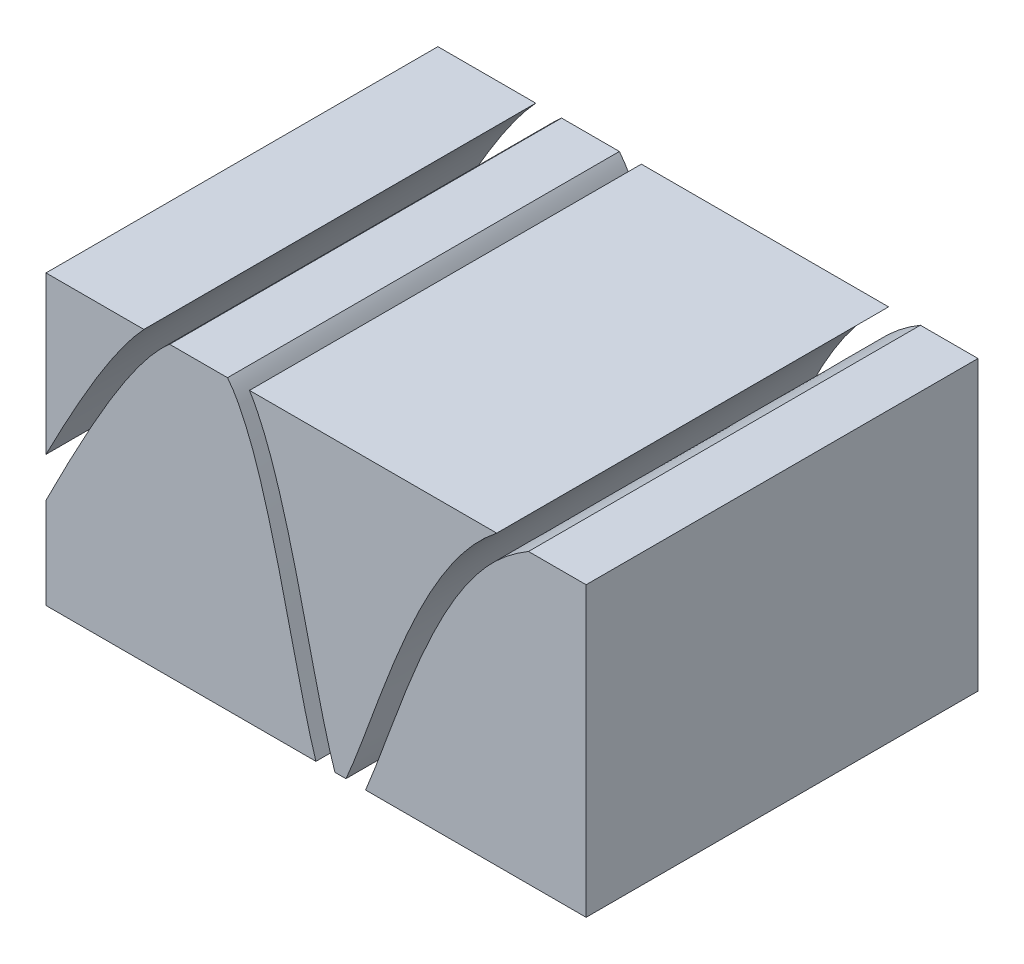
ISO-10303-21;
HEADER;
FILE_DESCRIPTION(('STEP AP214'),'2;1');
FILE_NAME('part.step','',(''),(''),'','','');
FILE_SCHEMA(('AUTOMOTIVE_DESIGN { 1 0 10303 214 1 1 1 1 }'));
ENDSEC;
DATA;
#1=APPLICATION_CONTEXT('core data for automotive mechanical design processes');
#2=APPLICATION_PROTOCOL_DEFINITION('international standard','automotive_design',2000,#1);
#3=PRODUCT_CONTEXT('',#1,'mechanical');
#4=PRODUCT('Part','Part','',(#3));
#5=PRODUCT_RELATED_PRODUCT_CATEGORY('part','',(#4));
#6=PRODUCT_DEFINITION_FORMATION('','',#4);
#7=PRODUCT_DEFINITION_CONTEXT('part definition',#1,'design');
#8=PRODUCT_DEFINITION('design','',#6,#7);
#9=PRODUCT_DEFINITION_SHAPE('','',#8);
#10=(LENGTH_UNIT() NAMED_UNIT(*) SI_UNIT(.MILLI.,.METRE.));
#11=(NAMED_UNIT(*) PLANE_ANGLE_UNIT() SI_UNIT($,.RADIAN.));
#12=(NAMED_UNIT(*) SI_UNIT($,.STERADIAN.) SOLID_ANGLE_UNIT());
#13=UNCERTAINTY_MEASURE_WITH_UNIT(LENGTH_MEASURE(1.E-05),#10,'distance_accuracy_value','');
#14=(GEOMETRIC_REPRESENTATION_CONTEXT(3) GLOBAL_UNCERTAINTY_ASSIGNED_CONTEXT((#13)) GLOBAL_UNIT_ASSIGNED_CONTEXT((#10,
#11,#12)) REPRESENTATION_CONTEXT('',''));
#15=CARTESIAN_POINT('',(0.,0.,0.));
#16=DIRECTION('',(0.,0.,1.));
#17=DIRECTION('',(1.,0.,0.));
#18=AXIS2_PLACEMENT_3D('',#15,#16,#17);
#19=CARTESIAN_POINT('',(-75.,-40.,-54.415169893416));
#20=DIRECTION('',(0.,0.,1.));
#21=DIRECTION('',(1.,0.,0.));
#22=AXIS2_PLACEMENT_3D('',#19,#20,#21);
#23=PLANE('',#22);
#24=DIRECTION('',(-1.,0.,0.));
#25=VECTOR('',#24,1.);
#26=CARTESIAN_POINT('',(-75.,40.,-54.415169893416));
#27=LINE('',#26,#25);
#28=CARTESIAN_POINT('',(-47.8204537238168,39.9999999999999,-54.4151698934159));
#29=VERTEX_POINT('',#28);
#30=CARTESIAN_POINT('',(-75.,40.,-54.415169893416));
#31=VERTEX_POINT('',#30);
#32=EDGE_CURVE('E87',#29,#31,#27,.T.);
#33=ORIENTED_EDGE('',*,*,#32,.F.);
#34=CARTESIAN_POINT('',(-47.8204537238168,39.9999999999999,-54.4151698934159));
#35=CARTESIAN_POINT('',(-48.0650466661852,39.7351296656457,-54.415169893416));
#36=CARTESIAN_POINT('',(-48.307176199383,39.4679981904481,-54.415169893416));
#37=CARTESIAN_POINT('',(-48.7868126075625,38.9296408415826,-54.415169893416));
#38=CARTESIAN_POINT('',(-49.0243197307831,38.6584151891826,-54.415169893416));
#39=CARTESIAN_POINT('',(-49.4949771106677,38.112343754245,-54.415169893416));
#40=CARTESIAN_POINT('',(-49.7281285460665,37.8374989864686,-54.415169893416));
#41=CARTESIAN_POINT('',(-50.190425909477,37.2844584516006,-54.415169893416));
#42=CARTESIAN_POINT('',(-50.4195717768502,37.0062626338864,-54.415169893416));
#43=CARTESIAN_POINT('',(-51.0991656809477,36.1698689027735,-54.415169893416));
#44=CARTESIAN_POINT('',(-51.5440828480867,35.6071684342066,-54.415169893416));
#45=CARTESIAN_POINT('',(-52.4209459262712,34.4717149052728,-54.415169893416));
#46=CARTESIAN_POINT('',(-52.8528907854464,33.8989610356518,-54.415169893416));
#47=CARTESIAN_POINT('',(-53.7044083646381,32.7462050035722,-54.415169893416));
#48=CARTESIAN_POINT('',(-54.1240052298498,32.1662206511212,-54.415169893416));
#49=CARTESIAN_POINT('',(-54.9530478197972,30.9990770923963,-54.415169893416));
#50=CARTESIAN_POINT('',(-55.3624938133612,30.4119180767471,-54.415169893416));
#51=CARTESIAN_POINT('',(-56.1720463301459,29.2318392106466,-54.415169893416));
#52=CARTESIAN_POINT('',(-56.5721594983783,28.638923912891,-54.415169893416));
#53=CARTESIAN_POINT('',(-57.3642988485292,27.4477163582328,-54.415169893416));
#54=CARTESIAN_POINT('',(-57.7563249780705,26.8494240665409,-54.415169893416));
#55=CARTESIAN_POINT('',(-58.5330438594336,25.6482256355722,-54.415169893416));
#56=CARTESIAN_POINT('',(-58.9177376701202,25.0453201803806,-54.415169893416));
#57=CARTESIAN_POINT('',(-59.6805541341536,23.8353634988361,-54.415169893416));
#58=CARTESIAN_POINT('',(-60.0586767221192,23.2283122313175,-54.415169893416));
#59=CARTESIAN_POINT('',(-61.1842126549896,21.4015408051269,-54.415169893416));
#60=CARTESIAN_POINT('',(-61.9227158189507,20.1763248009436,-54.415169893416));
#61=CARTESIAN_POINT('',(-63.378496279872,17.7169186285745,-54.415169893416));
#62=CARTESIAN_POINT('',(-64.09581550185,16.4827531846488,-54.415169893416));
#63=CARTESIAN_POINT('',(-65.5146536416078,14.0040624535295,-54.415169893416));
#64=CARTESIAN_POINT('',(-66.2161593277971,12.7595296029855,-54.415169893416));
#65=CARTESIAN_POINT('',(-67.6060739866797,10.2615762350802,-54.415169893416));
#66=CARTESIAN_POINT('',(-68.294469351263,9.00814815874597,-54.415169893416));
#67=CARTESIAN_POINT('',(-69.6603655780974,6.49359905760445,-54.415169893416));
#68=CARTESIAN_POINT('',(-70.3378536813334,5.23247111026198,-54.415169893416));
#69=CARTESIAN_POINT('',(-71.6837876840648,2.70353245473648,-54.415169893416));
#70=CARTESIAN_POINT('',(-72.352222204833,1.4357156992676,-54.415169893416));
#71=CARTESIAN_POINT('',(-73.681575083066,-1.10577640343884,-54.415169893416));
#72=CARTESIAN_POINT('',(-74.3424835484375,-2.37945692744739,-54.415169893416));
#73=CARTESIAN_POINT('',(-75.,-3.65487240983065,-54.415169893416));
#74=B_SPLINE_CURVE_WITH_KNOTS('',3,(#34,#35,#36,#37,#38,#39,#40,#41,#42,#43,#44,#45,#46,#47,#48,
#49,#50,#51,#52,#53,#54,#55,#56,#57,#58,#59,#60,#61,#62,#63,#64,#65,#66,#67,#68,#69,#70,#71,#72,
#73),.UNSPECIFIED.,.F.,.F.,(4,2,2,2,2,2,2,2,2,2,2,2,2,2,2,2,2,2,2,4),(0.,1.08156022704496,
2.16306220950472,3.24426714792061,4.32548844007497,6.47727767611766,8.62924092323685,
10.7766710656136,12.9240442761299,15.0698387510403,17.2156471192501,19.3611432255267,
21.5066606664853,25.798129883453,30.0804429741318,34.3662153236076,38.656217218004,
42.9509180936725,47.2505919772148,51.5553830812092),.UNSPECIFIED.);
#75=CARTESIAN_POINT('',(-75.,-3.65487240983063,-54.415169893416));
#76=VERTEX_POINT('',#75);
#77=EDGE_CURVE('E77',#29,#76,#74,.T.);
#78=ORIENTED_EDGE('',*,*,#77,.T.);
#79=DIRECTION('',(0.,-1.,0.));
#80=VECTOR('',#79,1.);
#81=CARTESIAN_POINT('',(-75.,40.,-54.415169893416));
#82=LINE('',#81,#80);
#83=EDGE_CURVE('E82',#31,#76,#82,.T.);
#84=ORIENTED_EDGE('',*,*,#83,.F.);
#85=EDGE_LOOP('',(#33,#78,#84));
#86=FACE_BOUND('',#85,.T.);
#87=ADVANCED_FACE('F44',(#86),#23,.F.);
#88=CARTESIAN_POINT('',(-75.,-40.,54.415169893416));
#89=DIRECTION('',(0.,0.,1.));
#90=DIRECTION('',(1.,0.,0.));
#91=AXIS2_PLACEMENT_3D('',#88,#89,#90);
#92=PLANE('',#91);
#93=CARTESIAN_POINT('',(-47.8204537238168,39.9999999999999,54.415169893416));
#94=CARTESIAN_POINT('',(-48.0650466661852,39.7351296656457,54.415169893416));
#95=CARTESIAN_POINT('',(-48.307176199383,39.4679981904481,54.415169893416));
#96=CARTESIAN_POINT('',(-48.7868126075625,38.9296408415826,54.415169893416));
#97=CARTESIAN_POINT('',(-49.0243197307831,38.6584151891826,54.415169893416));
#98=CARTESIAN_POINT('',(-49.4949771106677,38.112343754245,54.415169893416));
#99=CARTESIAN_POINT('',(-49.7281285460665,37.8374989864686,54.415169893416));
#100=CARTESIAN_POINT('',(-50.190425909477,37.2844584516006,54.415169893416));
#101=CARTESIAN_POINT('',(-50.4195717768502,37.0062626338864,54.415169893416));
#102=CARTESIAN_POINT('',(-51.0991656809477,36.1698689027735,54.415169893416));
#103=CARTESIAN_POINT('',(-51.5440828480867,35.6071684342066,54.415169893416));
#104=CARTESIAN_POINT('',(-52.4209459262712,34.4717149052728,54.415169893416));
#105=CARTESIAN_POINT('',(-52.8528907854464,33.8989610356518,54.415169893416));
#106=CARTESIAN_POINT('',(-53.7044083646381,32.7462050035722,54.415169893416));
#107=CARTESIAN_POINT('',(-54.1240052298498,32.1662206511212,54.415169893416));
#108=CARTESIAN_POINT('',(-54.9530478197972,30.9990770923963,54.415169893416));
#109=CARTESIAN_POINT('',(-55.3624938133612,30.4119180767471,54.415169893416));
#110=CARTESIAN_POINT('',(-56.1720463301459,29.2318392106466,54.415169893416));
#111=CARTESIAN_POINT('',(-56.5721594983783,28.638923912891,54.415169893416));
#112=CARTESIAN_POINT('',(-57.3642988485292,27.4477163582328,54.415169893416));
#113=CARTESIAN_POINT('',(-57.7563249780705,26.8494240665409,54.415169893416));
#114=CARTESIAN_POINT('',(-58.5330438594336,25.6482256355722,54.415169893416));
#115=CARTESIAN_POINT('',(-58.9177376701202,25.0453201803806,54.415169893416));
#116=CARTESIAN_POINT('',(-59.6805541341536,23.8353634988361,54.415169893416));
#117=CARTESIAN_POINT('',(-60.0586767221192,23.2283122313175,54.415169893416));
#118=CARTESIAN_POINT('',(-61.1842126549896,21.4015408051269,54.415169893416));
#119=CARTESIAN_POINT('',(-61.9227158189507,20.1763248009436,54.415169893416));
#120=CARTESIAN_POINT('',(-63.378496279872,17.7169186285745,54.415169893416));
#121=CARTESIAN_POINT('',(-64.09581550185,16.4827531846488,54.415169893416));
#122=CARTESIAN_POINT('',(-65.5146536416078,14.0040624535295,54.415169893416));
#123=CARTESIAN_POINT('',(-66.2161593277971,12.7595296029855,54.415169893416));
#124=CARTESIAN_POINT('',(-67.6060739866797,10.2615762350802,54.415169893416));
#125=CARTESIAN_POINT('',(-68.294469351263,9.00814815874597,54.415169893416));
#126=CARTESIAN_POINT('',(-69.6603655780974,6.49359905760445,54.415169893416));
#127=CARTESIAN_POINT('',(-70.3378536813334,5.23247111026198,54.415169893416));
#128=CARTESIAN_POINT('',(-71.6837876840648,2.70353245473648,54.415169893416));
#129=CARTESIAN_POINT('',(-72.352222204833,1.4357156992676,54.415169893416));
#130=CARTESIAN_POINT('',(-73.681575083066,-1.10577640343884,54.415169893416));
#131=CARTESIAN_POINT('',(-74.3424835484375,-2.37945692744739,54.415169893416));
#132=CARTESIAN_POINT('',(-75.,-3.65487240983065,54.415169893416));
#133=B_SPLINE_CURVE_WITH_KNOTS('',3,(#93,#94,#95,#96,#97,#98,#99,#100,#101,#102,#103,#104,#105,
#106,#107,#108,#109,#110,#111,#112,#113,#114,#115,#116,#117,#118,#119,#120,#121,#122,#123,#124,
#125,#126,#127,#128,#129,#130,#131,#132),.UNSPECIFIED.,.F.,.F.,(4,2,2,2,2,2,2,2,2,2,2,2,2,2,2,2,
2,2,2,4),(0.,1.08156022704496,2.16306220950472,3.24426714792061,4.32548844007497,
6.47727767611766,8.62924092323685,10.7766710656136,12.9240442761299,15.0698387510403,
17.2156471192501,19.3611432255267,21.5066606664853,25.798129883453,30.0804429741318,
34.3662153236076,38.656217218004,42.9509180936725,47.2505919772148,51.5553830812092),.UNSPECIFIED.);
#134=CARTESIAN_POINT('',(-47.8204537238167,40.,54.415169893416));
#135=VERTEX_POINT('',#134);
#136=CARTESIAN_POINT('',(-75.,-3.65487240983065,54.415169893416));
#137=VERTEX_POINT('',#136);
#138=EDGE_CURVE('E12',#135,#137,#133,.T.);
#139=ORIENTED_EDGE('',*,*,#138,.F.);
#140=DIRECTION('',(-1.,0.,0.));
#141=VECTOR('',#140,1.);
#142=CARTESIAN_POINT('',(-75.,40.,54.415169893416));
#143=LINE('',#142,#141);
#144=CARTESIAN_POINT('',(-75.,40.,54.415169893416));
#145=VERTEX_POINT('',#144);
#146=EDGE_CURVE('E48',#135,#145,#143,.T.);
#147=ORIENTED_EDGE('',*,*,#146,.T.);
#148=DIRECTION('',(0.,-1.,0.));
#149=VECTOR('',#148,1.);
#150=CARTESIAN_POINT('',(-75.,40.,54.415169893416));
#151=LINE('',#150,#149);
#152=EDGE_CURVE('E94',#145,#137,#151,.T.);
#153=ORIENTED_EDGE('',*,*,#152,.T.);
#154=EDGE_LOOP('',(#139,#147,#153));
#155=FACE_BOUND('',#154,.T.);
#156=ADVANCED_FACE('F102',(#155),#92,.T.);
#157=CARTESIAN_POINT('',(-75.,40.,54.415169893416));
#158=DIRECTION('',(0.,-1.,0.));
#159=DIRECTION('',(0.,0.,-1.));
#160=AXIS2_PLACEMENT_3D('',#157,#158,#159);
#161=PLANE('',#160);
#162=ORIENTED_EDGE('',*,*,#146,.F.);
#163=DIRECTION('',(0.,0.,-1.));
#164=VECTOR('',#163,1.);
#165=CARTESIAN_POINT('',(-47.8204537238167,40.,-4.02968962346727));
#166=LINE('',#165,#164);
#167=EDGE_CURVE('E60',#135,#29,#166,.T.);
#168=ORIENTED_EDGE('',*,*,#167,.T.);
#169=ORIENTED_EDGE('',*,*,#32,.T.);
#170=DIRECTION('',(0.,0.,-1.));
#171=VECTOR('',#170,1.);
#172=CARTESIAN_POINT('',(-75.,40.,54.415169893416));
#173=LINE('',#172,#171);
#174=EDGE_CURVE('E54',#145,#31,#173,.T.);
#175=ORIENTED_EDGE('',*,*,#174,.F.);
#176=EDGE_LOOP('',(#162,#168,#169,#175));
#177=FACE_BOUND('',#176,.T.);
#178=ADVANCED_FACE('F46',(#177),#161,.F.);
#179=CARTESIAN_POINT('',(-75.,40.,54.415169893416));
#180=DIRECTION('',(1.,0.,0.));
#181=DIRECTION('',(0.,0.,-1.));
#182=AXIS2_PLACEMENT_3D('',#179,#180,#181);
#183=PLANE('',#182);
#184=ORIENTED_EDGE('',*,*,#83,.T.);
#185=DIRECTION('',(0.,0.,-1.));
#186=VECTOR('',#185,1.);
#187=CARTESIAN_POINT('',(-75.,-3.65487240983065,-4.02968962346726));
#188=LINE('',#187,#186);
#189=EDGE_CURVE('E74',#76,#137,#188,.F.);
#190=ORIENTED_EDGE('',*,*,#189,.T.);
#191=ORIENTED_EDGE('',*,*,#152,.F.);
#192=ORIENTED_EDGE('',*,*,#174,.T.);
#193=EDGE_LOOP('',(#184,#190,#191,#192));
#194=FACE_BOUND('',#193,.T.);
#195=ADVANCED_FACE('F90',(#194),#183,.F.);
#196=CARTESIAN_POINT('',(-83.9374165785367,-32.6773889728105,54.415169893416));
#197=CARTESIAN_POINT('',(-62.3191849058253,11.1229468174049,54.415169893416));
#198=CARTESIAN_POINT('',(-19.1954598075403,98.4952013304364,54.415169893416));
#199=CARTESIAN_POINT('',(-4.17842900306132,-41.1856863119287,54.415169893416));
#200=CARTESIAN_POINT('',(4.56571127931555,-49.6995801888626,54.415169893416));
#201=B_SPLINE_CURVE_WITH_KNOTS('',3,(#196,#197,#198,#199,#200),.UNSPECIFIED.,.F.,.F.,(4,1,4),
(0.,0.279005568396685,0.55655613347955),.UNSPECIFIED.);
#202=DIRECTION('',(0.,0.,-1.));
#203=VECTOR('',#202,1.);
#204=SURFACE_OF_LINEAR_EXTRUSION('',#201,#203);
#205=OFFSET_SURFACE('',#204,5.,.F.);
#206=ORIENTED_EDGE('',*,*,#138,.T.);
#207=ORIENTED_EDGE('',*,*,#189,.F.);
#208=ORIENTED_EDGE('',*,*,#77,.F.);
#209=ORIENTED_EDGE('',*,*,#167,.F.);
#210=EDGE_LOOP('',(#206,#207,#208,#209));
#211=FACE_BOUND('',#210,.T.);
#212=ADVANCED_FACE('F76',(#211),#205,.F.);
#213=CLOSED_SHELL('',(#87,#156,#178,#195,#212));
#214=MANIFOLD_SOLID_BREP('B2',#213);
#215=CARTESIAN_POINT('',(-75.,-40.,-54.415169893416));
#216=DIRECTION('',(0.,0.,1.));
#217=DIRECTION('',(1.,0.,0.));
#218=AXIS2_PLACEMENT_3D('',#215,#216,#217);
#219=PLANE('',#218);
#220=DIRECTION('',(-1.,0.,0.));
#221=VECTOR('',#220,1.);
#222=CARTESIAN_POINT('',(-75.,40.,-54.415169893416));
#223=LINE('',#222,#221);
#224=CARTESIAN_POINT('',(50.1739328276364,40.,-54.415169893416));
#225=VERTEX_POINT('',#224);
#226=CARTESIAN_POINT('',(-18.4845193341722,40.,-54.415169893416));
#227=VERTEX_POINT('',#226);
#228=EDGE_CURVE('E230',#225,#227,#223,.T.);
#229=ORIENTED_EDGE('',*,*,#228,.F.);
#230=CARTESIAN_POINT('',(50.1739328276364,40.,-54.415169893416));
#231=CARTESIAN_POINT('',(49.8661701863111,39.7557694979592,-54.415169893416));
#232=CARTESIAN_POINT('',(49.5610902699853,39.5081865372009,-54.415169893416));
#233=CARTESIAN_POINT('',(48.9564054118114,39.0064277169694,-54.415169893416));
#234=CARTESIAN_POINT('',(48.6568004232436,38.7522519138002,-54.415169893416));
#235=CARTESIAN_POINT('',(47.7692635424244,37.9825199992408,-54.415169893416));
#236=CARTESIAN_POINT('',(47.1895914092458,37.4573631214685,-54.415169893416));
#237=CARTESIAN_POINT('',(46.3383616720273,36.6523158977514,-54.415169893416));
#238=CARTESIAN_POINT('',(46.0581088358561,36.3815389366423,-54.415169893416));
#239=CARTESIAN_POINT('',(45.5033876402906,35.8341128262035,-54.415169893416));
#240=CARTESIAN_POINT('',(45.2289192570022,35.5574637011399,-54.415169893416));
#241=CARTESIAN_POINT('',(44.6863760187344,34.9989855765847,-54.415169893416));
#242=CARTESIAN_POINT('',(44.4182900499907,34.7171673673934,-54.415169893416));
#243=CARTESIAN_POINT('',(43.8878941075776,34.148153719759,-54.415169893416));
#244=CARTESIAN_POINT('',(43.6255841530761,33.8609582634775,-54.415169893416));
#245=CARTESIAN_POINT('',(42.8474089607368,32.9923094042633,-54.415169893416));
#246=CARTESIAN_POINT('',(42.3398795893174,32.4033607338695,-54.415169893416));
#247=CARTESIAN_POINT('',(41.3457009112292,31.2081241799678,-54.415169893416));
#248=CARTESIAN_POINT('',(40.8590524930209,30.6018355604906,-54.415169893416));
#249=CARTESIAN_POINT('',(39.9136192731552,29.3849686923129,-54.415169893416));
#250=CARTESIAN_POINT('',(39.454494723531,28.7746539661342,-54.415169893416));
#251=CARTESIAN_POINT('',(38.5533772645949,27.5407777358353,-54.415169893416));
#252=CARTESIAN_POINT('',(38.1113984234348,26.9172059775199,-54.415169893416));
#253=CARTESIAN_POINT('',(37.243371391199,25.6583424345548,-54.415169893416));
#254=CARTESIAN_POINT('',(36.8173364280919,25.023041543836,-54.415169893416));
#255=CARTESIAN_POINT('',(35.9801437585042,23.7421532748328,-54.415169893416));
#256=CARTESIAN_POINT('',(35.5689956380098,23.0965596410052,-54.415169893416));
#257=CARTESIAN_POINT('',(34.7606431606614,21.7964400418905,-54.415169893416));
#258=CARTESIAN_POINT('',(34.3634430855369,21.1419114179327,-54.415169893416));
#259=CARTESIAN_POINT('',(33.5821590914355,19.8252132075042,-54.415169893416));
#260=CARTESIAN_POINT('',(33.1980732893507,19.1630447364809,-54.4151698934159));
#261=CARTESIAN_POINT('',(32.3009322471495,17.5834528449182,-54.4151698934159));
#262=CARTESIAN_POINT('',(31.7932345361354,16.6629850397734,-54.4151698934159));
#263=CARTESIAN_POINT('',(30.7987142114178,14.8115582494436,-54.415169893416));
#264=CARTESIAN_POINT('',(30.3118796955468,13.8806056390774,-54.415169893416));
#265=CARTESIAN_POINT('',(29.356877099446,12.009497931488,-54.415169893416));
#266=CARTESIAN_POINT('',(28.8887041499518,11.0693453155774,-54.415169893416));
#267=CARTESIAN_POINT('',(27.96909861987,9.18100201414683,-54.415169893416));
#268=CARTESIAN_POINT('',(27.5176646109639,8.23281202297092,-54.415169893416));
#269=CARTESIAN_POINT('',(26.6298285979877,6.32944694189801,-54.415169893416));
#270=CARTESIAN_POINT('',(26.1934263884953,5.37427194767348,-54.415169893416));
#271=CARTESIAN_POINT('',(25.3305588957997,3.44997207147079,-54.415169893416));
#272=CARTESIAN_POINT('',(24.904205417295,2.48079712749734,-54.415169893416));
#273=CARTESIAN_POINT('',(24.0637231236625,0.537133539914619,-54.415169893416));
#274=CARTESIAN_POINT('',(23.6495946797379,-0.437355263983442,-54.415169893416));
#275=CARTESIAN_POINT('',(22.8321645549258,-2.39092053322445,-54.415169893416));
#276=CARTESIAN_POINT('',(22.4288634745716,-3.3699972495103,-54.415169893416));
#277=CARTESIAN_POINT('',(21.6317661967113,-5.33204317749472,-54.415169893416));
#278=CARTESIAN_POINT('',(21.237970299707,-6.31501251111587,-54.415169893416));
#279=CARTESIAN_POINT('',(20.4586035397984,-8.28416509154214,-54.415169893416));
#280=CARTESIAN_POINT('',(20.0730324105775,-9.27034823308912,-54.415169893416));
#281=CARTESIAN_POINT('',(19.2091855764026,-11.5028060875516,-54.415169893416));
#282=CARTESIAN_POINT('',(18.732944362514,-12.7498672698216,-54.415169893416));
#283=CARTESIAN_POINT('',(17.7887517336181,-15.247033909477,-54.4151698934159));
#284=CARTESIAN_POINT('',(17.3207998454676,-16.4971391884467,-54.415169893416));
#285=CARTESIAN_POINT('',(16.3902010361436,-18.9992813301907,-54.415169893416));
#286=CARTESIAN_POINT('',(15.9275539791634,-20.2513181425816,-54.415169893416));
#287=CARTESIAN_POINT('',(15.004139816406,-22.7560458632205,-54.415169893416));
#288=CARTESIAN_POINT('',(14.5433726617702,-24.0087367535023,-54.415169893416));
#289=CARTESIAN_POINT('',(13.8530351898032,-25.8798837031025,-54.415169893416));
#290=CARTESIAN_POINT('',(13.6243951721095,-26.4986824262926,-54.415169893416));
#291=CARTESIAN_POINT('',(13.1658535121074,-27.7358105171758,-54.415169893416));
#292=CARTESIAN_POINT('',(12.9359518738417,-28.3541398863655,-54.415169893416));
#293=CARTESIAN_POINT('',(12.4741287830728,-29.590030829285,-54.415169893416));
#294=CARTESIAN_POINT('',(12.2422073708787,-30.2075924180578,-54.415169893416));
#295=CARTESIAN_POINT('',(11.7754024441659,-31.4416062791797,-54.415169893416));
#296=CARTESIAN_POINT('',(11.540518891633,-32.0580585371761,-54.415169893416));
#297=CARTESIAN_POINT('',(11.0665967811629,-33.2894307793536,-54.415169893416));
#298=CARTESIAN_POINT('',(10.827557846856,-33.9043506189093,-54.415169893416));
#299=CARTESIAN_POINT('',(10.3438364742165,-35.1319498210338,-54.415169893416));
#300=CARTESIAN_POINT('',(10.0991542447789,-35.7446292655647,-54.415169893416));
#301=CARTESIAN_POINT('',(9.72624978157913,-36.6614687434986,-54.415169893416));
#302=CARTESIAN_POINT('',(9.60092991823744,-36.9668092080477,-54.415169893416));
#303=CARTESIAN_POINT('',(9.34800244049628,-37.5765385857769,-54.415169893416));
#304=CARTESIAN_POINT('',(9.22039484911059,-37.880927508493,-54.415169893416));
#305=CARTESIAN_POINT('',(8.96247324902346,-38.4886040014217,-54.415169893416));
#306=CARTESIAN_POINT('',(8.83215890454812,-38.7918914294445,-54.415169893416));
#307=CARTESIAN_POINT('',(8.56829301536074,-39.3970662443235,-54.415169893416));
#308=CARTESIAN_POINT('',(8.43474135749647,-39.6989535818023,-54.415169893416));
#309=CARTESIAN_POINT('',(8.29930247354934,-40.,-54.415169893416));
#310=B_SPLINE_CURVE_WITH_KNOTS('',3,(#230,#231,#232,#233,#234,#235,#236,#237,#238,#239,#240,
#241,#242,#243,#244,#245,#246,#247,#248,#249,#250,#251,#252,#253,#254,#255,#256,#257,#258,#259,
#260,#261,#262,#263,#264,#265,#266,#267,#268,#269,#270,#271,#272,#273,#274,#275,#276,#277,#278,
#279,#280,#281,#282,#283,#284,#285,#286,#287,#288,#289,#290,#291,#292,#293,#294,#295,#296,#297,
#298,#299,#300,#301,#302,#303,#304,#305,#306,#307,#308,#309),.UNSPECIFIED.,.F.,.F.,(4,2,2,2,2,2,
2,2,2,2,2,2,2,2,2,2,2,2,2,2,2,2,2,2,2,2,2,2,2,2,2,2,2,2,2,2,2,2,2,4),(0.,1.17862641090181,
2.35724275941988,4.70292329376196,5.87194164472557,7.04095516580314,8.20775697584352,
9.37456265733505,11.7063685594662,14.038273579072,16.3291169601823,18.6218018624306,
20.9163485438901,23.2123473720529,25.5090449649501,27.8054113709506,30.9586962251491,
34.1101575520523,37.2607911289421,40.4111552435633,43.5614762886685,46.7378099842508,
49.9142400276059,53.0908458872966,56.2675520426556,59.4441551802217,63.4488233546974,
67.4532622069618,71.4575983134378,75.4618296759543,77.440892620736,79.4199492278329,
81.3989664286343,83.3780090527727,85.357231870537,87.3363815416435,88.3265461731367,
89.3167008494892,90.3069790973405,91.2972920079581),.UNSPECIFIED.);
#311=CARTESIAN_POINT('',(8.29930247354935,-40.,-54.415169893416));
#312=VERTEX_POINT('',#311);
#313=EDGE_CURVE('E42',#225,#312,#310,.T.);
#314=ORIENTED_EDGE('',*,*,#313,.T.);
#315=DIRECTION('',(1.,0.,0.));
#316=VECTOR('',#315,1.);
#317=CARTESIAN_POINT('',(-75.,-40.,-54.415169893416));
#318=LINE('',#317,#316);
#319=CARTESIAN_POINT('',(5.2373061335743,-40.,-54.415169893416));
#320=VERTEX_POINT('',#319);
#321=EDGE_CURVE('E225',#320,#312,#318,.T.);
#322=ORIENTED_EDGE('',*,*,#321,.F.);
#323=CARTESIAN_POINT('',(5.2373061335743,-40.,-54.415169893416));
#324=CARTESIAN_POINT('',(5.15685385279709,-39.7666405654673,-54.415169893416));
#325=CARTESIAN_POINT('',(5.07763011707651,-39.5328614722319,-54.415169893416));
#326=CARTESIAN_POINT('',(4.92138039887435,-39.0645749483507,-54.415169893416));
#327=CARTESIAN_POINT('',(4.84435437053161,-38.8300675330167,-54.415169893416));
#328=CARTESIAN_POINT('',(4.61619309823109,-38.1256484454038,-54.415169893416));
#329=CARTESIAN_POINT('',(4.46795974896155,-37.6547963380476,-54.415169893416));
#330=CARTESIAN_POINT('',(4.17791118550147,-36.71183076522,-54.415169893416));
#331=CARTESIAN_POINT('',(4.0360875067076,-36.2397198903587,-54.415169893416));
#332=CARTESIAN_POINT('',(3.75753148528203,-35.2939876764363,-54.415169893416));
#333=CARTESIAN_POINT('',(3.6207992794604,-34.820366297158,-54.415169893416));
#334=CARTESIAN_POINT('',(3.35165757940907,-33.8722152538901,-54.415169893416));
#335=CARTESIAN_POINT('',(3.21924547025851,-33.3976863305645,-54.415169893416));
#336=CARTESIAN_POINT('',(2.95798811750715,-32.4476541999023,-54.415169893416));
#337=CARTESIAN_POINT('',(2.82914284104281,-31.9721510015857,-54.415169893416));
#338=CARTESIAN_POINT('',(2.44718140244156,-30.5446981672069,-54.415169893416));
#339=CARTESIAN_POINT('',(2.19856622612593,-29.5915442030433,-54.415169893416));
#340=CARTESIAN_POINT('',(1.71004327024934,-27.6831366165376,-54.415169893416));
#341=CARTESIAN_POINT('',(1.47013450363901,-26.7278832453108,-54.415169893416));
#342=CARTESIAN_POINT('',(0.996620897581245,-24.8158450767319,-54.415169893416));
#343=CARTESIAN_POINT('',(0.763015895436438,-23.8590603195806,-54.415169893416));
#344=CARTESIAN_POINT('',(0.300506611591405,-21.9454464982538,-54.415169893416));
#345=CARTESIAN_POINT('',(0.071597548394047,-20.9886185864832,-54.415169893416));
#346=CARTESIAN_POINT('',(-0.383289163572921,-19.0741242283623,-54.415169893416));
#347=CARTESIAN_POINT('',(-0.60926639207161,-18.1164576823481,-54.415169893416));
#348=CARTESIAN_POINT('',(-1.05954071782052,-16.2005464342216,-54.415169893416));
#349=CARTESIAN_POINT('',(-1.28383750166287,-15.2423016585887,-54.415169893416));
#350=CARTESIAN_POINT('',(-1.73184229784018,-13.3254569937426,-54.415169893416));
#351=CARTESIAN_POINT('',(-1.95555017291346,-12.3668570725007,-54.415169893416));
#352=CARTESIAN_POINT('',(-2.40336506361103,-10.4495009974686,-54.415169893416));
#353=CARTESIAN_POINT('',(-2.6274721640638,-9.49074486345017,-54.415169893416));
#354=CARTESIAN_POINT('',(-3.07701170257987,-7.57326107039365,-54.415169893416));
#355=CARTESIAN_POINT('',(-3.30244449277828,-6.61453349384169,-54.415169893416));
#356=CARTESIAN_POINT('',(-3.836557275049,-4.35442619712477,-54.415169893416));
#357=CARTESIAN_POINT('',(-4.14614531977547,-3.05326050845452,-54.415169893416));
#358=CARTESIAN_POINT('',(-4.77153470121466,-0.452308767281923,-54.4151698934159));
#359=CARTESIAN_POINT('',(-5.08733653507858,0.847477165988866,-54.415169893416));
#360=CARTESIAN_POINT('',(-5.7273883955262,3.44467508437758,-54.415169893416));
#361=CARTESIAN_POINT('',(-6.05163658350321,4.74208752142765,-54.415169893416));
#362=CARTESIAN_POINT('',(-6.71104850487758,7.33348690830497,-54.415169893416));
#363=CARTESIAN_POINT('',(-7.04620696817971,8.62747519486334,-54.415169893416));
#364=CARTESIAN_POINT('',(-7.73029066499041,11.2108739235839,-54.415169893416));
#365=CARTESIAN_POINT('',(-8.07920636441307,12.500286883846,-54.415169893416));
#366=CARTESIAN_POINT('',(-8.79422725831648,15.0732571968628,-54.415169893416));
#367=CARTESIAN_POINT('',(-9.16031849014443,16.3568184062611,-54.415169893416));
#368=CARTESIAN_POINT('',(-9.72621486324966,18.2786895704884,-54.415169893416));
#369=CARTESIAN_POINT('',(-9.91785094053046,18.9194078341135,-54.415169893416));
#370=CARTESIAN_POINT('',(-10.3072748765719,20.1989700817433,-54.415169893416));
#371=CARTESIAN_POINT('',(-10.5050626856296,20.8378140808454,-54.415169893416));
#372=CARTESIAN_POINT('',(-10.9075206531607,22.1132527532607,-54.415169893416));
#373=CARTESIAN_POINT('',(-11.1121900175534,22.749847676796,-54.415169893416));
#374=CARTESIAN_POINT('',(-11.5293069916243,24.0204790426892,-54.415169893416));
#375=CARTESIAN_POINT('',(-11.7417544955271,24.6545155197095,-54.415169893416));
#376=CARTESIAN_POINT('',(-12.1755075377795,25.9197300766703,-54.415169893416));
#377=CARTESIAN_POINT('',(-12.3968152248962,26.550907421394,-54.415169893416));
#378=CARTESIAN_POINT('',(-12.8494486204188,27.8096576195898,-54.415169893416));
#379=CARTESIAN_POINT('',(-13.080774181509,28.4372305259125,-54.415169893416));
#380=CARTESIAN_POINT('',(-13.5551547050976,29.6887290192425,-54.415169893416));
#381=CARTESIAN_POINT('',(-13.7982223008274,30.3126498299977,-54.415169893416));
#382=CARTESIAN_POINT('',(-14.2976200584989,31.5552228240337,-54.415169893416));
#383=CARTESIAN_POINT('',(-14.5539510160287,32.1738746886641,-54.415169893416));
#384=CARTESIAN_POINT('',(-15.0828841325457,33.4066515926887,-54.415169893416));
#385=CARTESIAN_POINT('',(-15.355537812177,34.0207545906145,-54.415169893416));
#386=CARTESIAN_POINT('',(-15.9189557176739,35.2405247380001,-54.415169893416));
#387=CARTESIAN_POINT('',(-16.2097167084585,35.8461933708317,-54.415169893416));
#388=CARTESIAN_POINT('',(-16.663232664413,36.7491591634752,-54.415169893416));
#389=CARTESIAN_POINT('',(-16.8179898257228,37.0504828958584,-54.415169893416));
#390=CARTESIAN_POINT('',(-17.1334724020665,37.6499826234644,-54.415169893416));
#391=CARTESIAN_POINT('',(-17.2941975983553,37.9481587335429,-54.415169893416));
#392=CARTESIAN_POINT('',(-17.6222714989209,38.5410897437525,-54.415169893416));
#393=CARTESIAN_POINT('',(-17.7896241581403,38.8358424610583,-54.415169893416));
#394=CARTESIAN_POINT('',(-18.1315219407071,39.421193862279,-54.415169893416));
#395=CARTESIAN_POINT('',(-18.3060679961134,39.7117920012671,-54.415169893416));
#396=CARTESIAN_POINT('',(-18.4845193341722,40.,-54.415169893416));
#397=B_SPLINE_CURVE_WITH_KNOTS('',3,(#323,#324,#325,#326,#327,#328,#329,#330,#331,#332,#333,
#334,#335,#336,#337,#338,#339,#340,#341,#342,#343,#344,#345,#346,#347,#348,#349,#350,#351,#352,
#353,#354,#355,#356,#357,#358,#359,#360,#361,#362,#363,#364,#365,#366,#367,#368,#369,#370,#371,
#372,#373,#374,#375,#376,#377,#378,#379,#380,#381,#382,#383,#384,#385,#386,#387,#388,#389,#390,
#391,#392,#393,#394,#395,#396),.UNSPECIFIED.,.F.,.F.,(4,2,2,2,2,2,2,2,2,2,2,2,2,2,2,2,2,2,2,2,2,
2,2,2,2,2,2,2,2,2,2,2,2,2,2,2,4),(0.,0.740506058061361,1.48099665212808,2.96183963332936,
4.44066617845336,5.91953243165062,7.3974862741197,8.87542649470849,11.8304933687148,
14.7852241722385,17.7398786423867,20.6913581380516,23.6432561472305,26.5956916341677,
29.5487632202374,32.5025630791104,35.4571865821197,39.4696438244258,43.4824234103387,
47.4943366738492,51.5043399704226,55.5116114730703,59.5156799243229,61.5219447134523,
63.5281932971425,65.5342111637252,67.5402017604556,69.5466818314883,71.5531324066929,
73.5617920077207,75.5705722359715,77.5860665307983,79.6012017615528,80.6173710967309,
81.6335032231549,82.6502511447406,83.6671312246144),.UNSPECIFIED.);
#398=EDGE_CURVE('E184',#320,#227,#397,.T.);
#399=ORIENTED_EDGE('',*,*,#398,.T.);
#400=EDGE_LOOP('',(#229,#314,#322,#399));
#401=FACE_BOUND('',#400,.T.);
#402=ADVANCED_FACE('F171',(#401),#219,.F.);
#403=CARTESIAN_POINT('',(-75.,-40.,54.415169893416));
#404=DIRECTION('',(0.,0.,1.));
#405=DIRECTION('',(1.,0.,0.));
#406=AXIS2_PLACEMENT_3D('',#403,#404,#405);
#407=PLANE('',#406);
#408=CARTESIAN_POINT('',(50.1739328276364,40.,54.415169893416));
#409=CARTESIAN_POINT('',(49.8661701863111,39.7557694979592,54.415169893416));
#410=CARTESIAN_POINT('',(49.5610902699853,39.5081865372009,54.415169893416));
#411=CARTESIAN_POINT('',(48.9564054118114,39.0064277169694,54.415169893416));
#412=CARTESIAN_POINT('',(48.6568004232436,38.7522519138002,54.415169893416));
#413=CARTESIAN_POINT('',(47.7692635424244,37.9825199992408,54.415169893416));
#414=CARTESIAN_POINT('',(47.1895914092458,37.4573631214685,54.415169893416));
#415=CARTESIAN_POINT('',(46.3383616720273,36.6523158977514,54.415169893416));
#416=CARTESIAN_POINT('',(46.0581088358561,36.3815389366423,54.415169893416));
#417=CARTESIAN_POINT('',(45.5033876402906,35.8341128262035,54.415169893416));
#418=CARTESIAN_POINT('',(45.2289192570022,35.5574637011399,54.415169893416));
#419=CARTESIAN_POINT('',(44.6863760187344,34.9989855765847,54.415169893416));
#420=CARTESIAN_POINT('',(44.4182900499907,34.7171673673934,54.415169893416));
#421=CARTESIAN_POINT('',(43.8878941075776,34.148153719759,54.415169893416));
#422=CARTESIAN_POINT('',(43.6255841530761,33.8609582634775,54.415169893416));
#423=CARTESIAN_POINT('',(42.8474089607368,32.9923094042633,54.415169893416));
#424=CARTESIAN_POINT('',(42.3398795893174,32.4033607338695,54.415169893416));
#425=CARTESIAN_POINT('',(41.3457009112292,31.2081241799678,54.415169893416));
#426=CARTESIAN_POINT('',(40.8590524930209,30.6018355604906,54.415169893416));
#427=CARTESIAN_POINT('',(39.9136192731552,29.3849686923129,54.415169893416));
#428=CARTESIAN_POINT('',(39.454494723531,28.7746539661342,54.415169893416));
#429=CARTESIAN_POINT('',(38.5533772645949,27.5407777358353,54.415169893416));
#430=CARTESIAN_POINT('',(38.1113984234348,26.9172059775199,54.415169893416));
#431=CARTESIAN_POINT('',(37.243371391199,25.6583424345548,54.415169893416));
#432=CARTESIAN_POINT('',(36.8173364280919,25.023041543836,54.415169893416));
#433=CARTESIAN_POINT('',(35.9801437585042,23.7421532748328,54.415169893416));
#434=CARTESIAN_POINT('',(35.5689956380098,23.0965596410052,54.415169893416));
#435=CARTESIAN_POINT('',(34.7606431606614,21.7964400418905,54.415169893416));
#436=CARTESIAN_POINT('',(34.3634430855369,21.1419114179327,54.415169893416));
#437=CARTESIAN_POINT('',(33.5821590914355,19.8252132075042,54.415169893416));
#438=CARTESIAN_POINT('',(33.1980732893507,19.1630447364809,54.415169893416));
#439=CARTESIAN_POINT('',(32.3009322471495,17.5834528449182,54.415169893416));
#440=CARTESIAN_POINT('',(31.7932345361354,16.6629850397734,54.415169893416));
#441=CARTESIAN_POINT('',(30.7987142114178,14.8115582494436,54.4151698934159));
#442=CARTESIAN_POINT('',(30.3118796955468,13.8806056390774,54.415169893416));
#443=CARTESIAN_POINT('',(29.356877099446,12.009497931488,54.415169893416));
#444=CARTESIAN_POINT('',(28.8887041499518,11.0693453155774,54.415169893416));
#445=CARTESIAN_POINT('',(27.96909861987,9.18100201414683,54.415169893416));
#446=CARTESIAN_POINT('',(27.5176646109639,8.23281202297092,54.415169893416));
#447=CARTESIAN_POINT('',(26.6298285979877,6.32944694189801,54.415169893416));
#448=CARTESIAN_POINT('',(26.1934263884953,5.37427194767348,54.415169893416));
#449=CARTESIAN_POINT('',(25.3305588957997,3.44997207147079,54.415169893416));
#450=CARTESIAN_POINT('',(24.904205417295,2.48079712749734,54.415169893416));
#451=CARTESIAN_POINT('',(24.0637231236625,0.537133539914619,54.415169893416));
#452=CARTESIAN_POINT('',(23.6495946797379,-0.437355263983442,54.415169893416));
#453=CARTESIAN_POINT('',(22.8321645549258,-2.39092053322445,54.415169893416));
#454=CARTESIAN_POINT('',(22.4288634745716,-3.3699972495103,54.415169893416));
#455=CARTESIAN_POINT('',(21.6317661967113,-5.33204317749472,54.415169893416));
#456=CARTESIAN_POINT('',(21.237970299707,-6.31501251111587,54.415169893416));
#457=CARTESIAN_POINT('',(20.4586035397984,-8.28416509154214,54.415169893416));
#458=CARTESIAN_POINT('',(20.0730324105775,-9.27034823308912,54.415169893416));
#459=CARTESIAN_POINT('',(19.2091855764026,-11.5028060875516,54.415169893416));
#460=CARTESIAN_POINT('',(18.732944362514,-12.7498672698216,54.415169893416));
#461=CARTESIAN_POINT('',(17.7887517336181,-15.247033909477,54.415169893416));
#462=CARTESIAN_POINT('',(17.3207998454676,-16.4971391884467,54.415169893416));
#463=CARTESIAN_POINT('',(16.3902010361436,-18.9992813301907,54.415169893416));
#464=CARTESIAN_POINT('',(15.9275539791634,-20.2513181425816,54.415169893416));
#465=CARTESIAN_POINT('',(15.004139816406,-22.7560458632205,54.415169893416));
#466=CARTESIAN_POINT('',(14.5433726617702,-24.0087367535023,54.415169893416));
#467=CARTESIAN_POINT('',(13.8530351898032,-25.8798837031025,54.415169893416));
#468=CARTESIAN_POINT('',(13.6243951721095,-26.4986824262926,54.415169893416));
#469=CARTESIAN_POINT('',(13.1658535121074,-27.7358105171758,54.415169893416));
#470=CARTESIAN_POINT('',(12.9359518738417,-28.3541398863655,54.415169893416));
#471=CARTESIAN_POINT('',(12.4741287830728,-29.590030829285,54.415169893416));
#472=CARTESIAN_POINT('',(12.2422073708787,-30.2075924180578,54.415169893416));
#473=CARTESIAN_POINT('',(11.7754024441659,-31.4416062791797,54.415169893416));
#474=CARTESIAN_POINT('',(11.540518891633,-32.0580585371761,54.415169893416));
#475=CARTESIAN_POINT('',(11.0665967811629,-33.2894307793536,54.415169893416));
#476=CARTESIAN_POINT('',(10.827557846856,-33.9043506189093,54.415169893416));
#477=CARTESIAN_POINT('',(10.3438364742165,-35.1319498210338,54.415169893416));
#478=CARTESIAN_POINT('',(10.0991542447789,-35.7446292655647,54.415169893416));
#479=CARTESIAN_POINT('',(9.72624978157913,-36.6614687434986,54.415169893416));
#480=CARTESIAN_POINT('',(9.60092991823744,-36.9668092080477,54.415169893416));
#481=CARTESIAN_POINT('',(9.34800244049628,-37.5765385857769,54.415169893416));
#482=CARTESIAN_POINT('',(9.22039484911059,-37.880927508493,54.415169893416));
#483=CARTESIAN_POINT('',(8.96247324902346,-38.4886040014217,54.415169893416));
#484=CARTESIAN_POINT('',(8.83215890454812,-38.7918914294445,54.415169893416));
#485=CARTESIAN_POINT('',(8.56829301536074,-39.3970662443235,54.415169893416));
#486=CARTESIAN_POINT('',(8.43474135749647,-39.6989535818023,54.415169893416));
#487=CARTESIAN_POINT('',(8.29930247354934,-40.,54.415169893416));
#488=B_SPLINE_CURVE_WITH_KNOTS('',3,(#408,#409,#410,#411,#412,#413,#414,#415,#416,#417,#418,
#419,#420,#421,#422,#423,#424,#425,#426,#427,#428,#429,#430,#431,#432,#433,#434,#435,#436,#437,
#438,#439,#440,#441,#442,#443,#444,#445,#446,#447,#448,#449,#450,#451,#452,#453,#454,#455,#456,
#457,#458,#459,#460,#461,#462,#463,#464,#465,#466,#467,#468,#469,#470,#471,#472,#473,#474,#475,
#476,#477,#478,#479,#480,#481,#482,#483,#484,#485,#486,#487),.UNSPECIFIED.,.F.,.F.,(4,2,2,2,2,2,
2,2,2,2,2,2,2,2,2,2,2,2,2,2,2,2,2,2,2,2,2,2,2,2,2,2,2,2,2,2,2,2,2,4),(0.,1.17862641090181,
2.35724275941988,4.70292329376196,5.87194164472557,7.04095516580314,8.20775697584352,
9.37456265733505,11.7063685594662,14.038273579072,16.3291169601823,18.6218018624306,
20.9163485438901,23.2123473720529,25.5090449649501,27.8054113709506,30.9586962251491,
34.1101575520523,37.2607911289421,40.4111552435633,43.5614762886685,46.7378099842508,
49.9142400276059,53.0908458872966,56.2675520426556,59.4441551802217,63.4488233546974,
67.4532622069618,71.4575983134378,75.4618296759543,77.440892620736,79.4199492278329,
81.3989664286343,83.3780090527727,85.357231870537,87.3363815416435,88.3265461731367,
89.3167008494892,90.3069790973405,91.2972920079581),.UNSPECIFIED.);
#489=CARTESIAN_POINT('',(50.1739328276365,40.,54.415169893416));
#490=VERTEX_POINT('',#489);
#491=CARTESIAN_POINT('',(8.29930247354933,-40.,54.415169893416));
#492=VERTEX_POINT('',#491);
#493=EDGE_CURVE('E231',#490,#492,#488,.T.);
#494=ORIENTED_EDGE('',*,*,#493,.F.);
#495=DIRECTION('',(-1.,0.,0.));
#496=VECTOR('',#495,1.);
#497=CARTESIAN_POINT('',(-75.,40.,54.415169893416));
#498=LINE('',#497,#496);
#499=CARTESIAN_POINT('',(-18.4845193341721,40.,54.415169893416));
#500=VERTEX_POINT('',#499);
#501=EDGE_CURVE('E221',#490,#500,#498,.T.);
#502=ORIENTED_EDGE('',*,*,#501,.T.);
#503=CARTESIAN_POINT('',(5.2373061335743,-40.,54.415169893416));
#504=CARTESIAN_POINT('',(5.15685385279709,-39.7666405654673,54.415169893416));
#505=CARTESIAN_POINT('',(5.07763011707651,-39.5328614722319,54.415169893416));
#506=CARTESIAN_POINT('',(4.92138039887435,-39.0645749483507,54.415169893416));
#507=CARTESIAN_POINT('',(4.84435437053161,-38.8300675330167,54.415169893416));
#508=CARTESIAN_POINT('',(4.61619309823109,-38.1256484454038,54.415169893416));
#509=CARTESIAN_POINT('',(4.46795974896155,-37.6547963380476,54.415169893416));
#510=CARTESIAN_POINT('',(4.17791118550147,-36.71183076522,54.415169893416));
#511=CARTESIAN_POINT('',(4.0360875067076,-36.2397198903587,54.415169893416));
#512=CARTESIAN_POINT('',(3.75753148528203,-35.2939876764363,54.415169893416));
#513=CARTESIAN_POINT('',(3.6207992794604,-34.820366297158,54.415169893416));
#514=CARTESIAN_POINT('',(3.35165757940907,-33.8722152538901,54.415169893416));
#515=CARTESIAN_POINT('',(3.21924547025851,-33.3976863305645,54.415169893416));
#516=CARTESIAN_POINT('',(2.95798811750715,-32.4476541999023,54.415169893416));
#517=CARTESIAN_POINT('',(2.82914284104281,-31.9721510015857,54.415169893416));
#518=CARTESIAN_POINT('',(2.44718140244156,-30.5446981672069,54.415169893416));
#519=CARTESIAN_POINT('',(2.19856622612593,-29.5915442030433,54.415169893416));
#520=CARTESIAN_POINT('',(1.71004327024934,-27.6831366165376,54.415169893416));
#521=CARTESIAN_POINT('',(1.47013450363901,-26.7278832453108,54.415169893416));
#522=CARTESIAN_POINT('',(0.996620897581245,-24.8158450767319,54.415169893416));
#523=CARTESIAN_POINT('',(0.763015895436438,-23.8590603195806,54.415169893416));
#524=CARTESIAN_POINT('',(0.300506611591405,-21.9454464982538,54.415169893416));
#525=CARTESIAN_POINT('',(0.071597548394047,-20.9886185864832,54.415169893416));
#526=CARTESIAN_POINT('',(-0.383289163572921,-19.0741242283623,54.415169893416));
#527=CARTESIAN_POINT('',(-0.60926639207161,-18.1164576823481,54.415169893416));
#528=CARTESIAN_POINT('',(-1.05954071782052,-16.2005464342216,54.415169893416));
#529=CARTESIAN_POINT('',(-1.28383750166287,-15.2423016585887,54.415169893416));
#530=CARTESIAN_POINT('',(-1.73184229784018,-13.3254569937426,54.415169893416));
#531=CARTESIAN_POINT('',(-1.95555017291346,-12.3668570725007,54.415169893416));
#532=CARTESIAN_POINT('',(-2.40336506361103,-10.4495009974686,54.415169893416));
#533=CARTESIAN_POINT('',(-2.6274721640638,-9.49074486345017,54.415169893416));
#534=CARTESIAN_POINT('',(-3.07701170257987,-7.57326107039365,54.415169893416));
#535=CARTESIAN_POINT('',(-3.30244449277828,-6.61453349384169,54.415169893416));
#536=CARTESIAN_POINT('',(-3.836557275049,-4.35442619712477,54.415169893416));
#537=CARTESIAN_POINT('',(-4.14614531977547,-3.05326050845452,54.415169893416));
#538=CARTESIAN_POINT('',(-4.77153470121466,-0.452308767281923,54.415169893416));
#539=CARTESIAN_POINT('',(-5.08733653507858,0.847477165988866,54.415169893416));
#540=CARTESIAN_POINT('',(-5.7273883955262,3.44467508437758,54.415169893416));
#541=CARTESIAN_POINT('',(-6.05163658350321,4.74208752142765,54.415169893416));
#542=CARTESIAN_POINT('',(-6.71104850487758,7.33348690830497,54.415169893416));
#543=CARTESIAN_POINT('',(-7.04620696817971,8.62747519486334,54.415169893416));
#544=CARTESIAN_POINT('',(-7.73029066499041,11.2108739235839,54.415169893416));
#545=CARTESIAN_POINT('',(-8.07920636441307,12.500286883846,54.415169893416));
#546=CARTESIAN_POINT('',(-8.79422725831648,15.0732571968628,54.415169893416));
#547=CARTESIAN_POINT('',(-9.16031849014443,16.3568184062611,54.415169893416));
#548=CARTESIAN_POINT('',(-9.72621486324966,18.2786895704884,54.415169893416));
#549=CARTESIAN_POINT('',(-9.91785094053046,18.9194078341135,54.415169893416));
#550=CARTESIAN_POINT('',(-10.3072748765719,20.1989700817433,54.415169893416));
#551=CARTESIAN_POINT('',(-10.5050626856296,20.8378140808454,54.415169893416));
#552=CARTESIAN_POINT('',(-10.9075206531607,22.1132527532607,54.415169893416));
#553=CARTESIAN_POINT('',(-11.1121900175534,22.749847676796,54.415169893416));
#554=CARTESIAN_POINT('',(-11.5293069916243,24.0204790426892,54.415169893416));
#555=CARTESIAN_POINT('',(-11.7417544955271,24.6545155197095,54.415169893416));
#556=CARTESIAN_POINT('',(-12.1755075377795,25.9197300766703,54.415169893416));
#557=CARTESIAN_POINT('',(-12.3968152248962,26.550907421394,54.415169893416));
#558=CARTESIAN_POINT('',(-12.8494486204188,27.8096576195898,54.415169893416));
#559=CARTESIAN_POINT('',(-13.080774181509,28.4372305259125,54.415169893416));
#560=CARTESIAN_POINT('',(-13.5551547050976,29.6887290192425,54.415169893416));
#561=CARTESIAN_POINT('',(-13.7982223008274,30.3126498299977,54.415169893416));
#562=CARTESIAN_POINT('',(-14.2976200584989,31.5552228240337,54.415169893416));
#563=CARTESIAN_POINT('',(-14.5539510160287,32.1738746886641,54.415169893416));
#564=CARTESIAN_POINT('',(-15.0828841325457,33.4066515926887,54.415169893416));
#565=CARTESIAN_POINT('',(-15.355537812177,34.0207545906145,54.415169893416));
#566=CARTESIAN_POINT('',(-15.9189557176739,35.2405247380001,54.415169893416));
#567=CARTESIAN_POINT('',(-16.2097167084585,35.8461933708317,54.415169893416));
#568=CARTESIAN_POINT('',(-16.663232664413,36.7491591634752,54.415169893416));
#569=CARTESIAN_POINT('',(-16.8179898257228,37.0504828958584,54.415169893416));
#570=CARTESIAN_POINT('',(-17.1334724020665,37.6499826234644,54.415169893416));
#571=CARTESIAN_POINT('',(-17.2941975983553,37.9481587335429,54.415169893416));
#572=CARTESIAN_POINT('',(-17.6222714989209,38.5410897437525,54.415169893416));
#573=CARTESIAN_POINT('',(-17.7896241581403,38.8358424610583,54.415169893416));
#574=CARTESIAN_POINT('',(-18.1315219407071,39.421193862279,54.415169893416));
#575=CARTESIAN_POINT('',(-18.3060679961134,39.7117920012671,54.415169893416));
#576=CARTESIAN_POINT('',(-18.4845193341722,40.,54.415169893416));
#577=B_SPLINE_CURVE_WITH_KNOTS('',3,(#503,#504,#505,#506,#507,#508,#509,#510,#511,#512,#513,
#514,#515,#516,#517,#518,#519,#520,#521,#522,#523,#524,#525,#526,#527,#528,#529,#530,#531,#532,
#533,#534,#535,#536,#537,#538,#539,#540,#541,#542,#543,#544,#545,#546,#547,#548,#549,#550,#551,
#552,#553,#554,#555,#556,#557,#558,#559,#560,#561,#562,#563,#564,#565,#566,#567,#568,#569,#570,
#571,#572,#573,#574,#575,#576),.UNSPECIFIED.,.F.,.F.,(4,2,2,2,2,2,2,2,2,2,2,2,2,2,2,2,2,2,2,2,2,
2,2,2,2,2,2,2,2,2,2,2,2,2,2,2,4),(0.,0.740506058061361,1.48099665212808,2.96183963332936,
4.44066617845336,5.91953243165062,7.3974862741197,8.87542649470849,11.8304933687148,
14.7852241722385,17.7398786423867,20.6913581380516,23.6432561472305,26.5956916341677,
29.5487632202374,32.5025630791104,35.4571865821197,39.4696438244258,43.4824234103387,
47.4943366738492,51.5043399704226,55.5116114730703,59.5156799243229,61.5219447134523,
63.5281932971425,65.5342111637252,67.5402017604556,69.5466818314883,71.5531324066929,
73.5617920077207,75.5705722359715,77.5860665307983,79.6012017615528,80.6173710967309,
81.6335032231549,82.6502511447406,83.6671312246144),.UNSPECIFIED.);
#578=CARTESIAN_POINT('',(5.23730613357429,-40.,54.415169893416));
#579=VERTEX_POINT('',#578);
#580=EDGE_CURVE('E228',#579,#500,#577,.T.);
#581=ORIENTED_EDGE('',*,*,#580,.F.);
#582=DIRECTION('',(1.,0.,0.));
#583=VECTOR('',#582,1.);
#584=CARTESIAN_POINT('',(-75.,-40.,54.415169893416));
#585=LINE('',#584,#583);
#586=EDGE_CURVE('E227',#579,#492,#585,.T.);
#587=ORIENTED_EDGE('',*,*,#586,.T.);
#588=EDGE_LOOP('',(#494,#502,#581,#587));
#589=FACE_BOUND('',#588,.T.);
#590=ADVANCED_FACE('F263',(#589),#407,.T.);
#591=CARTESIAN_POINT('',(-75.,40.,54.415169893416));
#592=DIRECTION('',(0.,-1.,0.));
#593=DIRECTION('',(0.,0.,-1.));
#594=AXIS2_PLACEMENT_3D('',#591,#592,#593);
#595=PLANE('',#594);
#596=ORIENTED_EDGE('',*,*,#501,.F.);
#597=DIRECTION('',(0.,0.,-1.));
#598=VECTOR('',#597,1.);
#599=CARTESIAN_POINT('',(50.1739328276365,40.,-4.02968962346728));
#600=LINE('',#599,#598);
#601=EDGE_CURVE('E261',#490,#225,#600,.T.);
#602=ORIENTED_EDGE('',*,*,#601,.T.);
#603=ORIENTED_EDGE('',*,*,#228,.T.);
#604=DIRECTION('',(0.,0.,-1.));
#605=VECTOR('',#604,1.);
#606=CARTESIAN_POINT('',(-18.4845193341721,40.,-4.02968962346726));
#607=LINE('',#606,#605);
#608=EDGE_CURVE('E198',#227,#500,#607,.F.);
#609=ORIENTED_EDGE('',*,*,#608,.T.);
#610=EDGE_LOOP('',(#596,#602,#603,#609));
#611=FACE_BOUND('',#610,.T.);
#612=ADVANCED_FACE('F266',(#611),#595,.F.);
#613=CARTESIAN_POINT('',(-75.,-40.,54.415169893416));
#614=DIRECTION('',(0.,1.,0.));
#615=DIRECTION('',(0.,0.,1.));
#616=AXIS2_PLACEMENT_3D('',#613,#614,#615);
#617=PLANE('',#616);
#618=ORIENTED_EDGE('',*,*,#321,.T.);
#619=DIRECTION('',(0.,0.,-1.));
#620=VECTOR('',#619,1.);
#621=CARTESIAN_POINT('',(8.29930247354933,-40.,-4.02968962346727));
#622=LINE('',#621,#620);
#623=EDGE_CURVE('E191',#312,#492,#622,.F.);
#624=ORIENTED_EDGE('',*,*,#623,.T.);
#625=ORIENTED_EDGE('',*,*,#586,.F.);
#626=DIRECTION('',(0.,0.,-1.));
#627=VECTOR('',#626,1.);
#628=CARTESIAN_POINT('',(5.23730613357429,-40.,-4.02968962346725));
#629=LINE('',#628,#627);
#630=EDGE_CURVE('E215',#579,#320,#629,.T.);
#631=ORIENTED_EDGE('',*,*,#630,.T.);
#632=EDGE_LOOP('',(#618,#624,#625,#631));
#633=FACE_BOUND('',#632,.T.);
#634=ADVANCED_FACE('F173',(#633),#617,.F.);
#635=CARTESIAN_POINT('',(-83.9374165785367,-32.6773889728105,54.415169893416));
#636=CARTESIAN_POINT('',(-62.3191849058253,11.1229468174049,54.415169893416));
#637=CARTESIAN_POINT('',(-19.1954598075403,98.4952013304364,54.415169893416));
#638=CARTESIAN_POINT('',(-4.17842900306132,-41.1856863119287,54.415169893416));
#639=CARTESIAN_POINT('',(4.56571127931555,-49.6995801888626,54.415169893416));
#640=B_SPLINE_CURVE_WITH_KNOTS('',3,(#635,#636,#637,#638,#639),.UNSPECIFIED.,.F.,.F.,(4,1,4),
(0.,0.279005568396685,0.55655613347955),.UNSPECIFIED.);
#641=DIRECTION('',(0.,0.,-1.));
#642=VECTOR('',#641,1.);
#643=SURFACE_OF_LINEAR_EXTRUSION('',#640,#642);
#644=OFFSET_SURFACE('',#643,5.,.F.);
#645=ORIENTED_EDGE('',*,*,#580,.T.);
#646=ORIENTED_EDGE('',*,*,#608,.F.);
#647=ORIENTED_EDGE('',*,*,#398,.F.);
#648=ORIENTED_EDGE('',*,*,#630,.F.);
#649=EDGE_LOOP('',(#645,#646,#647,#648));
#650=FACE_BOUND('',#649,.T.);
#651=ADVANCED_FACE('F214',(#650),#644,.F.);
#652=CARTESIAN_POINT('',(8.03397982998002,-49.8455940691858,54.415169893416));
#653=CARTESIAN_POINT('',(16.3153921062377,-43.1567192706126,54.415169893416));
#654=CARTESIAN_POINT('',(33.416597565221,42.2513173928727,54.415169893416));
#655=CARTESIAN_POINT('',(80.1645868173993,48.1284728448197,54.415169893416));
#656=CARTESIAN_POINT('',(98.3780554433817,50.4182694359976,54.415169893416));
#657=B_SPLINE_CURVE_WITH_KNOTS('',3,(#652,#653,#654,#655,#656),.UNSPECIFIED.,.F.,.F.,(4,1,4),
(0.592370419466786,0.841183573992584,1.),.UNSPECIFIED.);
#658=DIRECTION('',(0.,0.,-1.));
#659=VECTOR('',#658,1.);
#660=SURFACE_OF_LINEAR_EXTRUSION('',#657,#659);
#661=OFFSET_SURFACE('',#660,5.,.F.);
#662=ORIENTED_EDGE('',*,*,#493,.T.);
#663=ORIENTED_EDGE('',*,*,#623,.F.);
#664=ORIENTED_EDGE('',*,*,#313,.F.);
#665=ORIENTED_EDGE('',*,*,#601,.F.);
#666=EDGE_LOOP('',(#662,#663,#664,#665));
#667=FACE_BOUND('',#666,.T.);
#668=ADVANCED_FACE('F252',(#667),#661,.F.);
#669=CLOSED_SHELL('',(#402,#590,#612,#634,#651,#668));
#670=MANIFOLD_SOLID_BREP('B6',#669);
#671=CARTESIAN_POINT('',(-75.,-40.,54.415169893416));
#672=DIRECTION('',(0.,1.,0.));
#673=DIRECTION('',(0.,0.,1.));
#674=AXIS2_PLACEMENT_3D('',#671,#672,#673);
#675=PLANE('',#674);
#676=DIRECTION('',(0.,0.,-1.));
#677=VECTOR('',#676,1.);
#678=CARTESIAN_POINT('',(13.7526061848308,-40.,54.4151698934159));
#679=LINE('',#678,#677);
#680=CARTESIAN_POINT('',(13.7526061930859,-39.9999999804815,-54.4151698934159));
#681=VERTEX_POINT('',#680);
#682=CARTESIAN_POINT('',(13.7526061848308,-40.,54.415169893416));
#683=VERTEX_POINT('',#682);
#684=EDGE_CURVE('E169',#681,#683,#679,.F.);
#685=ORIENTED_EDGE('',*,*,#684,.F.);
#686=DIRECTION('',(1.,0.,0.));
#687=VECTOR('',#686,1.);
#688=CARTESIAN_POINT('',(-75.,-40.,-54.415169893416));
#689=LINE('',#688,#687);
#690=CARTESIAN_POINT('',(75.,-40.,-54.415169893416));
#691=VERTEX_POINT('',#690);
#692=EDGE_CURVE('E390',#681,#691,#689,.T.);
#693=ORIENTED_EDGE('',*,*,#692,.T.);
#694=DIRECTION('',(0.,0.,-1.));
#695=VECTOR('',#694,1.);
#696=CARTESIAN_POINT('',(75.,-40.,54.415169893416));
#697=LINE('',#696,#695);
#698=CARTESIAN_POINT('',(75.,-40.,54.415169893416));
#699=VERTEX_POINT('',#698);
#700=EDGE_CURVE('E419',#699,#691,#697,.T.);
#701=ORIENTED_EDGE('',*,*,#700,.F.);
#702=DIRECTION('',(1.,0.,0.));
#703=VECTOR('',#702,1.);
#704=CARTESIAN_POINT('',(-75.,-40.,54.415169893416));
#705=LINE('',#704,#703);
#706=EDGE_CURVE('E392',#683,#699,#705,.T.);
#707=ORIENTED_EDGE('',*,*,#706,.F.);
#708=EDGE_LOOP('',(#685,#693,#701,#707));
#709=FACE_BOUND('',#708,.T.);
#710=ADVANCED_FACE('F342',(#709),#675,.F.);
#711=CARTESIAN_POINT('',(-75.,40.,54.415169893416));
#712=DIRECTION('',(0.,-1.,0.));
#713=DIRECTION('',(0.,0.,-1.));
#714=AXIS2_PLACEMENT_3D('',#711,#712,#713);
#715=PLANE('',#714);
#716=DIRECTION('',(0.,0.,-1.));
#717=VECTOR('',#716,1.);
#718=CARTESIAN_POINT('',(58.999523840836,40.,54.415169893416));
#719=LINE('',#718,#717);
#720=CARTESIAN_POINT('',(58.999523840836,40.,54.415169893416));
#721=VERTEX_POINT('',#720);
#722=CARTESIAN_POINT('',(58.9995238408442,40.,-54.415169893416));
#723=VERTEX_POINT('',#722);
#724=EDGE_CURVE('E379',#721,#723,#719,.T.);
#725=ORIENTED_EDGE('',*,*,#724,.F.);
#726=DIRECTION('',(-1.,0.,0.));
#727=VECTOR('',#726,1.);
#728=CARTESIAN_POINT('',(-75.,40.,54.415169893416));
#729=LINE('',#728,#727);
#730=CARTESIAN_POINT('',(75.,40.,54.415169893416));
#731=VERTEX_POINT('',#730);
#732=EDGE_CURVE('E406',#731,#721,#729,.T.);
#733=ORIENTED_EDGE('',*,*,#732,.F.);
#734=DIRECTION('',(0.,0.,-1.));
#735=VECTOR('',#734,1.);
#736=CARTESIAN_POINT('',(75.,40.,54.415169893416));
#737=LINE('',#736,#735);
#738=CARTESIAN_POINT('',(75.,40.,-54.415169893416));
#739=VERTEX_POINT('',#738);
#740=EDGE_CURVE('E396',#731,#739,#737,.T.);
#741=ORIENTED_EDGE('',*,*,#740,.T.);
#742=DIRECTION('',(-1.,0.,0.));
#743=VECTOR('',#742,1.);
#744=CARTESIAN_POINT('',(-75.,40.,-54.415169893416));
#745=LINE('',#744,#743);
#746=EDGE_CURVE('E399',#739,#723,#745,.T.);
#747=ORIENTED_EDGE('',*,*,#746,.T.);
#748=EDGE_LOOP('',(#725,#733,#741,#747));
#749=FACE_BOUND('',#748,.T.);
#750=ADVANCED_FACE('F426',(#749),#715,.F.);
#751=CARTESIAN_POINT('',(-75.,-40.,54.415169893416));
#752=DIRECTION('',(0.,0.,1.));
#753=DIRECTION('',(1.,0.,0.));
#754=AXIS2_PLACEMENT_3D('',#751,#752,#753);
#755=PLANE('',#754);
#756=ORIENTED_EDGE('',*,*,#732,.T.);
#757=CARTESIAN_POINT('',(-83.9374165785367,-32.6773889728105,54.415169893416));
#758=CARTESIAN_POINT('',(-62.3191849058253,11.1229468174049,54.415169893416));
#759=CARTESIAN_POINT('',(-18.3374950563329,100.233509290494,54.415169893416));
#760=CARTESIAN_POINT('',(3.51419900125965,-117.708859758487,54.415169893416));
#761=CARTESIAN_POINT('',(30.5791952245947,41.8945992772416,54.415169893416));
#762=CARTESIAN_POINT('',(80.1645868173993,48.1284728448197,54.415169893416));
#763=CARTESIAN_POINT('',(98.3780554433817,50.4182694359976,54.415169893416));
#764=B_SPLINE_CURVE_WITH_KNOTS('',3,(#757,#758,#759,#760,#761,#762,#763),.UNSPECIFIED.,.F.,.F.,
(4,1,1,1,4),(0.,0.279005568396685,0.567629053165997,0.841183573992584,1.),.UNSPECIFIED.);
#765=EDGE_CURVE('E361',#721,#683,#764,.F.);
#766=ORIENTED_EDGE('',*,*,#765,.T.);
#767=ORIENTED_EDGE('',*,*,#706,.T.);
#768=DIRECTION('',(0.,1.,0.));
#769=VECTOR('',#768,1.);
#770=CARTESIAN_POINT('',(75.,40.,54.415169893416));
#771=LINE('',#770,#769);
#772=EDGE_CURVE('E414',#699,#731,#771,.T.);
#773=ORIENTED_EDGE('',*,*,#772,.T.);
#774=EDGE_LOOP('',(#756,#766,#767,#773));
#775=FACE_BOUND('',#774,.T.);
#776=ADVANCED_FACE('F427',(#775),#755,.T.);
#777=CARTESIAN_POINT('',(-75.,-40.,-54.415169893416));
#778=DIRECTION('',(0.,0.,1.));
#779=DIRECTION('',(1.,0.,0.));
#780=AXIS2_PLACEMENT_3D('',#777,#778,#779);
#781=PLANE('',#780);
#782=CARTESIAN_POINT('',(-83.9374165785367,-32.6773889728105,-54.4151698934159));
#783=CARTESIAN_POINT('',(-62.3191849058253,11.1229468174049,-54.4151698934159));
#784=CARTESIAN_POINT('',(-18.3374950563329,100.233509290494,-54.4151698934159));
#785=CARTESIAN_POINT('',(3.51419900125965,-117.708859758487,-54.4151698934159));
#786=CARTESIAN_POINT('',(30.5791952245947,41.8945992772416,-54.4151698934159));
#787=CARTESIAN_POINT('',(80.1645868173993,48.1284728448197,-54.4151698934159));
#788=CARTESIAN_POINT('',(98.3780554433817,50.4182694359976,-54.4151698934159));
#789=B_SPLINE_CURVE_WITH_KNOTS('',3,(#782,#783,#784,#785,#786,#787,#788),.UNSPECIFIED.,.F.,.F.,
(4,1,1,1,4),(0.,0.279005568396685,0.567629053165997,0.841183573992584,1.),.UNSPECIFIED.);
#790=EDGE_CURVE('E354',#723,#681,#789,.F.);
#791=ORIENTED_EDGE('',*,*,#790,.F.);
#792=ORIENTED_EDGE('',*,*,#746,.F.);
#793=DIRECTION('',(0.,1.,0.));
#794=VECTOR('',#793,1.);
#795=CARTESIAN_POINT('',(75.,40.,-54.415169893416));
#796=LINE('',#795,#794);
#797=EDGE_CURVE('E395',#691,#739,#796,.T.);
#798=ORIENTED_EDGE('',*,*,#797,.F.);
#799=ORIENTED_EDGE('',*,*,#692,.F.);
#800=EDGE_LOOP('',(#791,#792,#798,#799));
#801=FACE_BOUND('',#800,.T.);
#802=ADVANCED_FACE('F394',(#801),#781,.F.);
#803=CARTESIAN_POINT('',(75.,40.,54.415169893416));
#804=DIRECTION('',(-1.,0.,0.));
#805=DIRECTION('',(0.,0.,1.));
#806=AXIS2_PLACEMENT_3D('',#803,#804,#805);
#807=PLANE('',#806);
#808=ORIENTED_EDGE('',*,*,#797,.T.);
#809=ORIENTED_EDGE('',*,*,#740,.F.);
#810=ORIENTED_EDGE('',*,*,#772,.F.);
#811=ORIENTED_EDGE('',*,*,#700,.T.);
#812=EDGE_LOOP('',(#808,#809,#810,#811));
#813=FACE_BOUND('',#812,.T.);
#814=ADVANCED_FACE('F423',(#813),#807,.F.);
#815=CARTESIAN_POINT('',(-83.9374165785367,-32.6773889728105,54.415169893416));
#816=CARTESIAN_POINT('',(-62.3191849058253,11.1229468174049,54.415169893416));
#817=CARTESIAN_POINT('',(-18.3374950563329,100.233509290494,54.415169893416));
#818=CARTESIAN_POINT('',(3.51419900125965,-117.708859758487,54.415169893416));
#819=CARTESIAN_POINT('',(30.5791952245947,41.8945992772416,54.415169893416));
#820=CARTESIAN_POINT('',(80.1645868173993,48.1284728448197,54.415169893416));
#821=CARTESIAN_POINT('',(98.3780554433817,50.4182694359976,54.415169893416));
#822=B_SPLINE_CURVE_WITH_KNOTS('',3,(#815,#816,#817,#818,#819,#820,#821),.UNSPECIFIED.,.F.,.F.,
(4,1,1,1,4),(0.,0.279005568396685,0.567629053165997,0.841183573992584,1.),.UNSPECIFIED.);
#823=DIRECTION('',(0.,0.,-1.));
#824=VECTOR('',#823,1.);
#825=SURFACE_OF_LINEAR_EXTRUSION('',#822,#824);
#826=ORIENTED_EDGE('',*,*,#724,.T.);
#827=ORIENTED_EDGE('',*,*,#790,.T.);
#828=ORIENTED_EDGE('',*,*,#684,.T.);
#829=ORIENTED_EDGE('',*,*,#765,.F.);
#830=EDGE_LOOP('',(#826,#827,#828,#829));
#831=FACE_BOUND('',#830,.T.);
#832=ADVANCED_FACE('F344',(#831),#825,.T.);
#833=CLOSED_SHELL('',(#710,#750,#776,#802,#814,#832));
#834=MANIFOLD_SOLID_BREP('B36',#833);
#835=CARTESIAN_POINT('',(-75.,-40.,-54.415169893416));
#836=DIRECTION('',(0.,0.,1.));
#837=DIRECTION('',(1.,0.,0.));
#838=AXIS2_PLACEMENT_3D('',#835,#836,#837);
#839=PLANE('',#838);
#840=CARTESIAN_POINT('',(-83.9374165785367,-32.6773889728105,-54.4151698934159));
#841=CARTESIAN_POINT('',(-62.3191849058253,11.1229468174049,-54.4151698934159));
#842=CARTESIAN_POINT('',(-18.3374950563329,100.233509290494,-54.4151698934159));
#843=CARTESIAN_POINT('',(3.51419900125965,-117.708859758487,-54.4151698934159));
#844=CARTESIAN_POINT('',(30.5791952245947,41.8945992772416,-54.4151698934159));
#845=CARTESIAN_POINT('',(80.1645868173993,48.1284728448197,-54.4151698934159));
#846=CARTESIAN_POINT('',(98.3780554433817,50.4182694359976,-54.4151698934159));
#847=B_SPLINE_CURVE_WITH_KNOTS('',3,(#840,#841,#842,#843,#844,#845,#846),.UNSPECIFIED.,.F.,.F.,
(4,1,1,1,4),(0.,0.279005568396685,0.567629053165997,0.841183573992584,1.),.UNSPECIFIED.);
#848=CARTESIAN_POINT('',(-0.0323289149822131,-40.,-54.415169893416));
#849=VERTEX_POINT('',#848);
#850=CARTESIAN_POINT('',(-24.5892808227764,40.0000000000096,-54.4151698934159));
#851=VERTEX_POINT('',#850);
#852=EDGE_CURVE('E493',#849,#851,#847,.F.);
#853=ORIENTED_EDGE('',*,*,#852,.F.);
#854=DIRECTION('',(1.,0.,0.));
#855=VECTOR('',#854,1.);
#856=CARTESIAN_POINT('',(-75.,-40.,-54.415169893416));
#857=LINE('',#856,#855);
#858=CARTESIAN_POINT('',(-75.,-40.,-54.415169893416));
#859=VERTEX_POINT('',#858);
#860=EDGE_CURVE('E546',#859,#849,#857,.T.);
#861=ORIENTED_EDGE('',*,*,#860,.F.);
#862=DIRECTION('',(0.,-1.,0.));
#863=VECTOR('',#862,1.);
#864=CARTESIAN_POINT('',(-75.,40.,-54.415169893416));
#865=LINE('',#864,#863);
#866=CARTESIAN_POINT('',(-75.0000000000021,-14.6820164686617,-54.4151698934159));
#867=VERTEX_POINT('',#866);
#868=EDGE_CURVE('E538',#867,#859,#865,.T.);
#869=ORIENTED_EDGE('',*,*,#868,.F.);
#870=CARTESIAN_POINT('',(-40.6501858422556,40.,-54.415169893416));
#871=VERTEX_POINT('',#870);
#872=EDGE_CURVE('E559',#871,#867,#847,.F.);
#873=ORIENTED_EDGE('',*,*,#872,.F.);
#874=DIRECTION('',(-1.,0.,0.));
#875=VECTOR('',#874,1.);
#876=CARTESIAN_POINT('',(-75.,40.,-54.415169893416));
#877=LINE('',#876,#875);
#878=EDGE_CURVE('E554',#851,#871,#877,.T.);
#879=ORIENTED_EDGE('',*,*,#878,.F.);
#880=EDGE_LOOP('',(#853,#861,#869,#873,#879));
#881=FACE_BOUND('',#880,.T.);
#882=ADVANCED_FACE('F483',(#881),#839,.F.);
#883=CARTESIAN_POINT('',(-75.,-40.,54.415169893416));
#884=DIRECTION('',(0.,0.,1.));
#885=DIRECTION('',(1.,0.,0.));
#886=AXIS2_PLACEMENT_3D('',#883,#884,#885);
#887=PLANE('',#886);
#888=DIRECTION('',(1.,0.,0.));
#889=VECTOR('',#888,1.);
#890=CARTESIAN_POINT('',(-75.,-40.,54.415169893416));
#891=LINE('',#890,#889);
#892=CARTESIAN_POINT('',(-75.,-40.,54.415169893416));
#893=VERTEX_POINT('',#892);
#894=CARTESIAN_POINT('',(-0.0323289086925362,-40.,54.415169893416));
#895=VERTEX_POINT('',#894);
#896=EDGE_CURVE('E553',#893,#895,#891,.T.);
#897=ORIENTED_EDGE('',*,*,#896,.T.);
#898=CARTESIAN_POINT('',(-83.9374165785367,-32.6773889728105,54.415169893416));
#899=CARTESIAN_POINT('',(-62.3191849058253,11.1229468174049,54.415169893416));
#900=CARTESIAN_POINT('',(-18.3374950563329,100.233509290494,54.415169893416));
#901=CARTESIAN_POINT('',(3.51419900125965,-117.708859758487,54.415169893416));
#902=CARTESIAN_POINT('',(30.5791952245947,41.8945992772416,54.415169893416));
#903=CARTESIAN_POINT('',(80.1645868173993,48.1284728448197,54.415169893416));
#904=CARTESIAN_POINT('',(98.3780554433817,50.4182694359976,54.415169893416));
#905=B_SPLINE_CURVE_WITH_KNOTS('',3,(#898,#899,#900,#901,#902,#903,#904),.UNSPECIFIED.,.F.,.F.,
(4,1,1,1,4),(0.,0.279005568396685,0.567629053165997,0.841183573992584,1.),.UNSPECIFIED.);
#906=CARTESIAN_POINT('',(-24.5892808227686,40.,54.415169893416));
#907=VERTEX_POINT('',#906);
#908=EDGE_CURVE('E501',#895,#907,#905,.F.);
#909=ORIENTED_EDGE('',*,*,#908,.T.);
#910=DIRECTION('',(-1.,0.,0.));
#911=VECTOR('',#910,1.);
#912=CARTESIAN_POINT('',(-75.,40.,54.415169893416));
#913=LINE('',#912,#911);
#914=CARTESIAN_POINT('',(-40.6501858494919,40.,54.415169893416));
#915=VERTEX_POINT('',#914);
#916=EDGE_CURVE('E487',#907,#915,#913,.T.);
#917=ORIENTED_EDGE('',*,*,#916,.T.);
#918=CARTESIAN_POINT('',(-75.,-14.6820164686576,54.415169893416));
#919=VERTEX_POINT('',#918);
#920=EDGE_CURVE('E519',#915,#919,#905,.F.);
#921=ORIENTED_EDGE('',*,*,#920,.T.);
#922=DIRECTION('',(0.,-1.,0.));
#923=VECTOR('',#922,1.);
#924=CARTESIAN_POINT('',(-75.,40.,54.415169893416));
#925=LINE('',#924,#923);
#926=EDGE_CURVE('E531',#919,#893,#925,.T.);
#927=ORIENTED_EDGE('',*,*,#926,.T.);
#928=EDGE_LOOP('',(#897,#909,#917,#921,#927));
#929=FACE_BOUND('',#928,.T.);
#930=ADVANCED_FACE('F588',(#929),#887,.T.);
#931=CARTESIAN_POINT('',(-75.,40.,54.415169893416));
#932=DIRECTION('',(0.,-1.,0.));
#933=DIRECTION('',(0.,0.,-1.));
#934=AXIS2_PLACEMENT_3D('',#931,#932,#933);
#935=PLANE('',#934);
#936=DIRECTION('',(0.,0.,-1.));
#937=VECTOR('',#936,1.);
#938=CARTESIAN_POINT('',(-40.6501858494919,40.,54.4151698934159));
#939=LINE('',#938,#937);
#940=EDGE_CURVE('E545',#915,#871,#939,.T.);
#941=ORIENTED_EDGE('',*,*,#940,.F.);
#942=ORIENTED_EDGE('',*,*,#916,.F.);
#943=DIRECTION('',(0.,0.,-1.));
#944=VECTOR('',#943,1.);
#945=CARTESIAN_POINT('',(-24.5892808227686,40.,54.415169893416));
#946=LINE('',#945,#944);
#947=EDGE_CURVE('E340',#851,#907,#946,.F.);
#948=ORIENTED_EDGE('',*,*,#947,.F.);
#949=ORIENTED_EDGE('',*,*,#878,.T.);
#950=EDGE_LOOP('',(#941,#942,#948,#949));
#951=FACE_BOUND('',#950,.T.);
#952=ADVANCED_FACE('F585',(#951),#935,.F.);
#953=CARTESIAN_POINT('',(-75.,-40.,54.415169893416));
#954=DIRECTION('',(0.,1.,0.));
#955=DIRECTION('',(0.,0.,1.));
#956=AXIS2_PLACEMENT_3D('',#953,#954,#955);
#957=PLANE('',#956);
#958=DIRECTION('',(0.,0.,-1.));
#959=VECTOR('',#958,1.);
#960=CARTESIAN_POINT('',(-0.0323289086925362,-40.,54.415169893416));
#961=LINE('',#960,#959);
#962=EDGE_CURVE('E522',#895,#849,#961,.T.);
#963=ORIENTED_EDGE('',*,*,#962,.F.);
#964=ORIENTED_EDGE('',*,*,#896,.F.);
#965=DIRECTION('',(0.,0.,-1.));
#966=VECTOR('',#965,1.);
#967=CARTESIAN_POINT('',(-75.,-40.,54.415169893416));
#968=LINE('',#967,#966);
#969=EDGE_CURVE('E541',#893,#859,#968,.T.);
#970=ORIENTED_EDGE('',*,*,#969,.T.);
#971=ORIENTED_EDGE('',*,*,#860,.T.);
#972=EDGE_LOOP('',(#963,#964,#970,#971));
#973=FACE_BOUND('',#972,.T.);
#974=ADVANCED_FACE('F552',(#973),#957,.F.);
#975=CARTESIAN_POINT('',(-75.,40.,54.415169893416));
#976=DIRECTION('',(1.,0.,0.));
#977=DIRECTION('',(0.,0.,-1.));
#978=AXIS2_PLACEMENT_3D('',#975,#976,#977);
#979=PLANE('',#978);
#980=DIRECTION('',(0.,0.,-1.));
#981=VECTOR('',#980,1.);
#982=CARTESIAN_POINT('',(-75.,-14.6820164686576,54.415169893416));
#983=LINE('',#982,#981);
#984=EDGE_CURVE('E542',#867,#919,#983,.F.);
#985=ORIENTED_EDGE('',*,*,#984,.F.);
#986=ORIENTED_EDGE('',*,*,#868,.T.);
#987=ORIENTED_EDGE('',*,*,#969,.F.);
#988=ORIENTED_EDGE('',*,*,#926,.F.);
#989=EDGE_LOOP('',(#985,#986,#987,#988));
#990=FACE_BOUND('',#989,.T.);
#991=ADVANCED_FACE('F485',(#990),#979,.F.);
#992=CARTESIAN_POINT('',(-83.9374165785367,-32.6773889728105,54.415169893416));
#993=CARTESIAN_POINT('',(-62.3191849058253,11.1229468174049,54.415169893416));
#994=CARTESIAN_POINT('',(-18.3374950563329,100.233509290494,54.415169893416));
#995=CARTESIAN_POINT('',(3.51419900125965,-117.708859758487,54.415169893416));
#996=CARTESIAN_POINT('',(30.5791952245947,41.8945992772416,54.415169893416));
#997=CARTESIAN_POINT('',(80.1645868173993,48.1284728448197,54.415169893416));
#998=CARTESIAN_POINT('',(98.3780554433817,50.4182694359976,54.415169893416));
#999=B_SPLINE_CURVE_WITH_KNOTS('',3,(#992,#993,#994,#995,#996,#997,#998),.UNSPECIFIED.,.F.,.F.,
(4,1,1,1,4),(0.,0.279005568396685,0.567629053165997,0.841183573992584,1.),.UNSPECIFIED.);
#1000=DIRECTION('',(0.,0.,-1.));
#1001=VECTOR('',#1000,1.);
#1002=SURFACE_OF_LINEAR_EXTRUSION('',#999,#1001);
#1003=ORIENTED_EDGE('',*,*,#940,.T.);
#1004=ORIENTED_EDGE('',*,*,#872,.T.);
#1005=ORIENTED_EDGE('',*,*,#984,.T.);
#1006=ORIENTED_EDGE('',*,*,#920,.F.);
#1007=EDGE_LOOP('',(#1003,#1004,#1005,#1006));
#1008=FACE_BOUND('',#1007,.T.);
#1009=ADVANCED_FACE('F579',(#1008),#1002,.T.);
#1010=ORIENTED_EDGE('',*,*,#962,.T.);
#1011=ORIENTED_EDGE('',*,*,#852,.T.);
#1012=ORIENTED_EDGE('',*,*,#947,.T.);
#1013=ORIENTED_EDGE('',*,*,#908,.F.);
#1014=EDGE_LOOP('',(#1010,#1011,#1012,#1013));
#1015=FACE_BOUND('',#1014,.T.);
#1016=ADVANCED_FACE('F582',(#1015),#1002,.T.);
#1017=CLOSED_SHELL('',(#882,#930,#952,#974,#991,#1009,#1016));
#1018=MANIFOLD_SOLID_BREP('B163',#1017);
#1019=ADVANCED_BREP_SHAPE_REPRESENTATION('',(#18,#214,#670,#834,#1018),#14);
#1020=SHAPE_DEFINITION_REPRESENTATION(#9,#1019);
ENDSEC;
END-ISO-10303-21;
